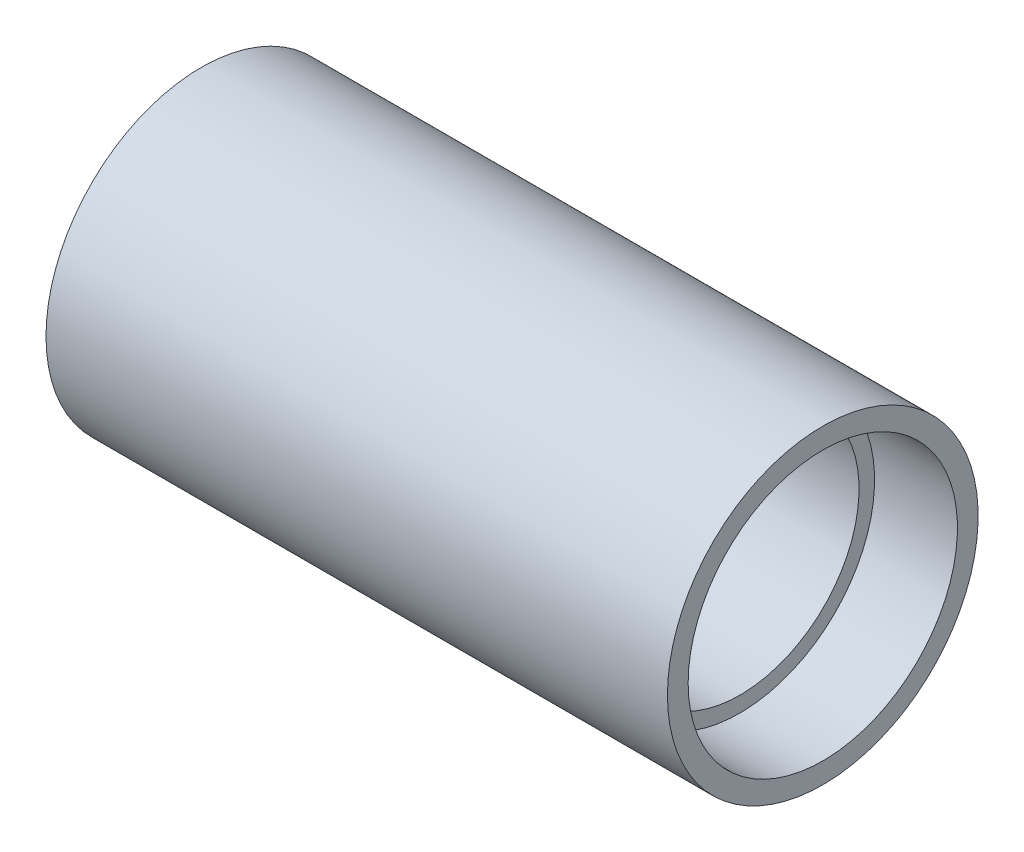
from build123d import *


with BuildPart() as part:
    # Esquisse1 → R_volution1 (revolve)
    with BuildSketch(Plane.XY, mode=Mode.PRIVATE) as r_volution1_sk:
        Polygon((0, 13), (0, 15), (60, 15), (60, 13), (52, 13), (52, 11.5), (8, 11.5), (8, 13), align=None)
    revolve(r_volution1_sk.sketch.rotate(Axis((-4.217239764, 0, 0), (1, 0, 0)), 90), axis=Axis((-4.217239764, 0, 0), (1, 0, 0)))


solid = part.part
